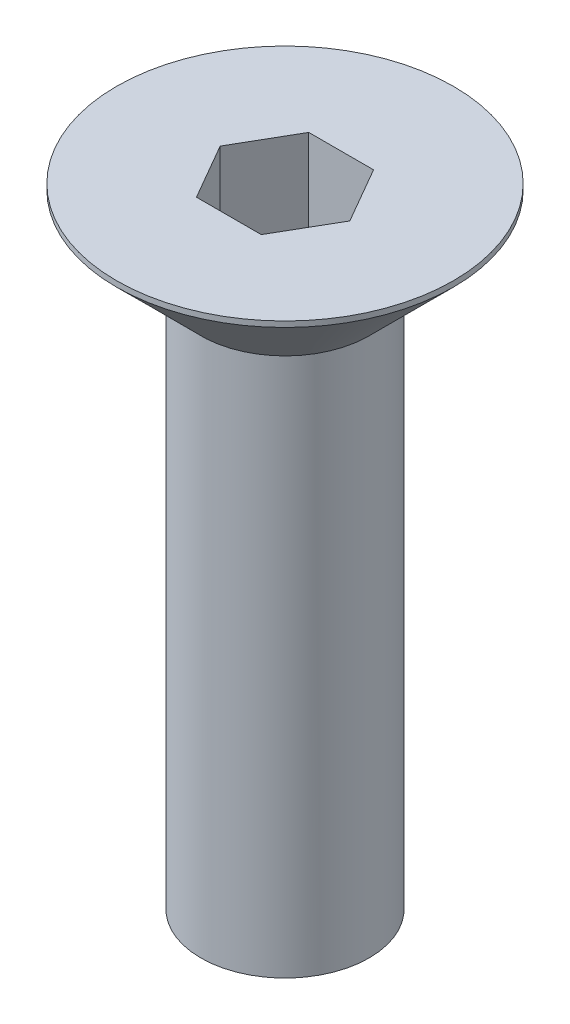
from build123d import *

# Parameters (mm, degrees)
CUT_EXTRUDE1_DEPTH = 2


with BuildPart() as part:
    # Sketch1 → Base-Revolve (revolve)
    with BuildSketch(Plane.XY, mode=Mode.PRIVATE) as base_revolve_sk:
        Polygon((0, -10), (0, 1.6), (3, 1.6), (3, 1.5), (1.5, 0), (1.5, -9.598076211), align=None)
    revolve(base_revolve_sk.sketch.rotate(Axis((0, 1.6, 0), (0, 1, 0)), 90), axis=Axis((0, 1.6, 0), (0, 1, 0)))

    # Sketch2 → Cut-Extrude1 (cut)
    with BuildSketch(Plane(origin=(0, 1.6, 0), x_dir=(-1, 0, 0), z_dir=(0, 1, 0))):
        Polygon((-1.154700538, 0), (-0.577350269, -1), (0.577350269, -1), (1.154700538, 0), (0.577350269, 1), (-0.577350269, 1), align=None)
    extrude(amount=-CUT_EXTRUDE1_DEPTH, mode=Mode.SUBTRACT)


solid = part.part
